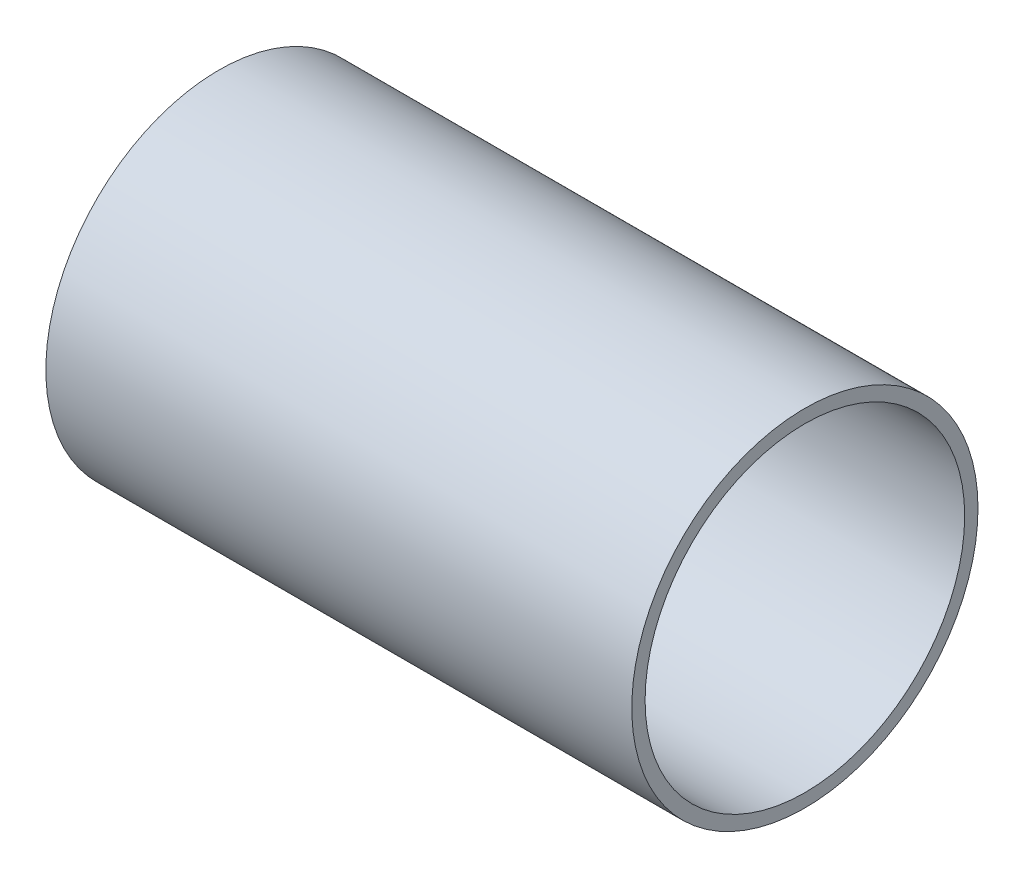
ISO-10303-21;
HEADER;
FILE_DESCRIPTION(('STEP AP214'),'2;1');
FILE_NAME('part.step','',(''),(''),'','','');
FILE_SCHEMA(('AUTOMOTIVE_DESIGN { 1 0 10303 214 1 1 1 1 }'));
ENDSEC;
DATA;
#1=APPLICATION_CONTEXT('core data for automotive mechanical design processes');
#2=APPLICATION_PROTOCOL_DEFINITION('international standard','automotive_design',2000,#1);
#3=PRODUCT_CONTEXT('',#1,'mechanical');
#4=PRODUCT('Part','Part','',(#3));
#5=PRODUCT_RELATED_PRODUCT_CATEGORY('part','',(#4));
#6=PRODUCT_DEFINITION_FORMATION('','',#4);
#7=PRODUCT_DEFINITION_CONTEXT('part definition',#1,'design');
#8=PRODUCT_DEFINITION('design','',#6,#7);
#9=PRODUCT_DEFINITION_SHAPE('','',#8);
#10=(LENGTH_UNIT() NAMED_UNIT(*) SI_UNIT(.MILLI.,.METRE.));
#11=(NAMED_UNIT(*) PLANE_ANGLE_UNIT() SI_UNIT($,.RADIAN.));
#12=(NAMED_UNIT(*) SI_UNIT($,.STERADIAN.) SOLID_ANGLE_UNIT());
#13=UNCERTAINTY_MEASURE_WITH_UNIT(LENGTH_MEASURE(1.E-05),#10,'distance_accuracy_value','');
#14=(GEOMETRIC_REPRESENTATION_CONTEXT(3) GLOBAL_UNCERTAINTY_ASSIGNED_CONTEXT((#13)) GLOBAL_UNIT_ASSIGNED_CONTEXT((#10,
#11,#12)) REPRESENTATION_CONTEXT('',''));
#15=CARTESIAN_POINT('',(0.,0.,0.));
#16=DIRECTION('',(0.,0.,1.));
#17=DIRECTION('',(1.,0.,0.));
#18=AXIS2_PLACEMENT_3D('',#15,#16,#17);
#19=CARTESIAN_POINT('',(-8.9214876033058,0.,0.));
#20=DIRECTION('',(1.,0.,0.));
#21=DIRECTION('',(0.,0.,-1.));
#22=AXIS2_PLACEMENT_3D('',#19,#20,#21);
#23=CYLINDRICAL_SURFACE('',#22,38.1);
#24=CARTESIAN_POINT('',(139.7,0.,0.));
#25=DIRECTION('',(1.,0.,0.));
#26=DIRECTION('',(0.,0.,-1.));
#27=AXIS2_PLACEMENT_3D('',#24,#25,#26);
#28=CIRCLE('',#27,38.1);
#29=CARTESIAN_POINT('',(139.7,0.,-38.1));
#30=VERTEX_POINT('',#29);
#31=EDGE_CURVE('E42',#30,#30,#28,.T.);
#32=ORIENTED_EDGE('',*,*,#31,.T.);
#33=EDGE_LOOP('',(#32));
#34=FACE_BOUND('',#33,.T.);
#35=CARTESIAN_POINT('',(0.,0.,0.));
#36=DIRECTION('',(1.,0.,0.));
#37=DIRECTION('',(0.,0.,-1.));
#38=AXIS2_PLACEMENT_3D('',#35,#36,#37);
#39=CIRCLE('',#38,38.1);
#40=CARTESIAN_POINT('',(0.,0.,-38.1));
#41=VERTEX_POINT('',#40);
#42=EDGE_CURVE('E10',#41,#41,#39,.T.);
#43=ORIENTED_EDGE('',*,*,#42,.F.);
#44=EDGE_LOOP('',(#43));
#45=FACE_BOUND('',#44,.T.);
#46=ADVANCED_FACE('F28',(#34,#45),#23,.F.);
#47=CARTESIAN_POINT('',(0.,38.1,0.));
#48=DIRECTION('',(-1.,0.,0.));
#49=DIRECTION('',(0.,0.,1.));
#50=AXIS2_PLACEMENT_3D('',#47,#48,#49);
#51=PLANE('',#50);
#52=ORIENTED_EDGE('',*,*,#42,.T.);
#53=EDGE_LOOP('',(#52));
#54=FACE_BOUND('',#53,.T.);
#55=CARTESIAN_POINT('',(0.,0.,0.));
#56=DIRECTION('',(1.,0.,0.));
#57=DIRECTION('',(0.,0.,-1.));
#58=AXIS2_PLACEMENT_3D('',#55,#56,#57);
#59=CIRCLE('',#58,41.275);
#60=CARTESIAN_POINT('',(0.,0.,-41.275));
#61=VERTEX_POINT('',#60);
#62=EDGE_CURVE('E34',#61,#61,#59,.T.);
#63=ORIENTED_EDGE('',*,*,#62,.F.);
#64=EDGE_LOOP('',(#63));
#65=FACE_BOUND('',#64,.T.);
#66=ADVANCED_FACE('F58',(#54,#65),#51,.T.);
#67=CARTESIAN_POINT('',(-8.9214876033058,0.,0.));
#68=DIRECTION('',(1.,0.,0.));
#69=DIRECTION('',(0.,0.,-1.));
#70=AXIS2_PLACEMENT_3D('',#67,#68,#69);
#71=CYLINDRICAL_SURFACE('',#70,41.275);
#72=ORIENTED_EDGE('',*,*,#62,.T.);
#73=EDGE_LOOP('',(#72));
#74=FACE_BOUND('',#73,.T.);
#75=CARTESIAN_POINT('',(139.7,0.,0.));
#76=DIRECTION('',(1.,0.,0.));
#77=DIRECTION('',(0.,0.,-1.));
#78=AXIS2_PLACEMENT_3D('',#75,#76,#77);
#79=CIRCLE('',#78,41.275);
#80=CARTESIAN_POINT('',(139.7,0.,-41.275));
#81=VERTEX_POINT('',#80);
#82=EDGE_CURVE('E38',#81,#81,#79,.T.);
#83=ORIENTED_EDGE('',*,*,#82,.F.);
#84=EDGE_LOOP('',(#83));
#85=FACE_BOUND('',#84,.T.);
#86=ADVANCED_FACE('F52',(#74,#85),#71,.T.);
#87=CARTESIAN_POINT('',(139.7,41.275,0.));
#88=DIRECTION('',(1.,0.,0.));
#89=DIRECTION('',(0.,0.,-1.));
#90=AXIS2_PLACEMENT_3D('',#87,#88,#89);
#91=PLANE('',#90);
#92=ORIENTED_EDGE('',*,*,#82,.T.);
#93=EDGE_LOOP('',(#92));
#94=FACE_BOUND('',#93,.T.);
#95=ORIENTED_EDGE('',*,*,#31,.F.);
#96=EDGE_LOOP('',(#95));
#97=FACE_BOUND('',#96,.T.);
#98=ADVANCED_FACE('F50',(#94,#97),#91,.T.);
#99=CLOSED_SHELL('',(#46,#66,#86,#98));
#100=MANIFOLD_SOLID_BREP('B2',#99);
#101=ADVANCED_BREP_SHAPE_REPRESENTATION('',(#18,#100),#14);
#102=SHAPE_DEFINITION_REPRESENTATION(#9,#101);
ENDSEC;
END-ISO-10303-21;
